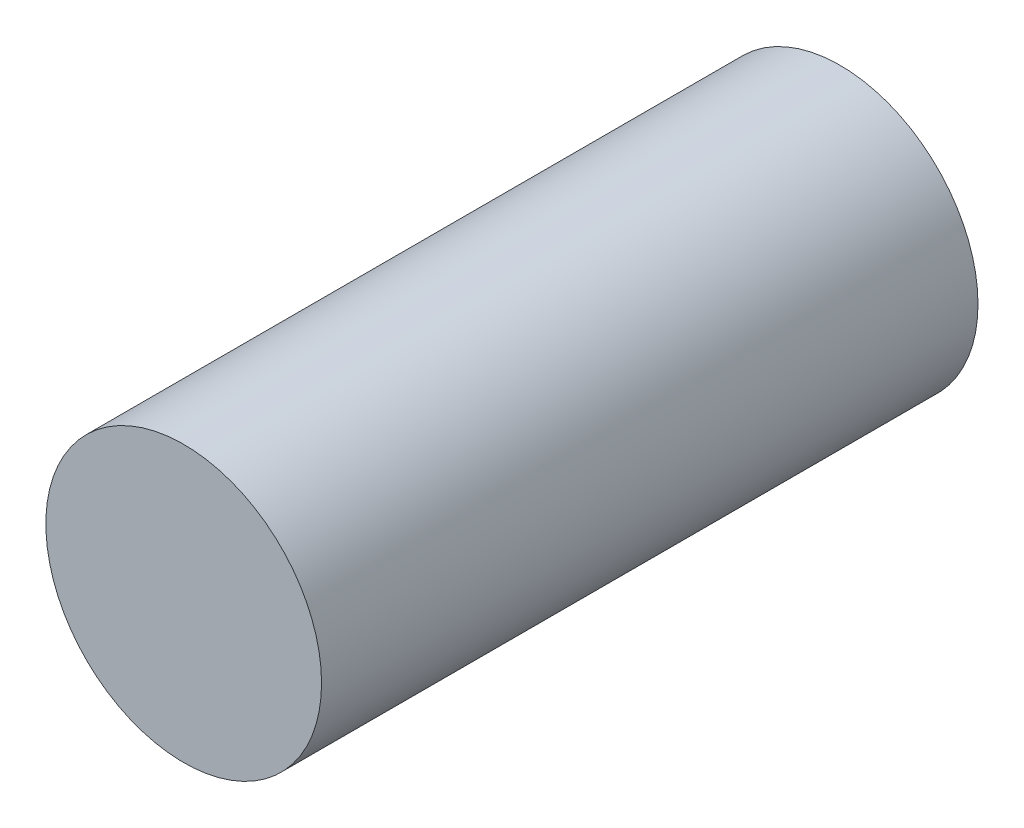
from build123d import *

# Parameters (mm, degrees)
CROQUIS1_R              = 10.5
SALIENTE_EXTRUIR1_DEPTH = 50


with BuildPart() as part:
    # Croquis1 → Saliente-Extruir1 (new body)
    with BuildSketch(Plane.XY):
        Circle(CROQUIS1_R)
    extrude(amount=SALIENTE_EXTRUIR1_DEPTH)


solid = part.part
